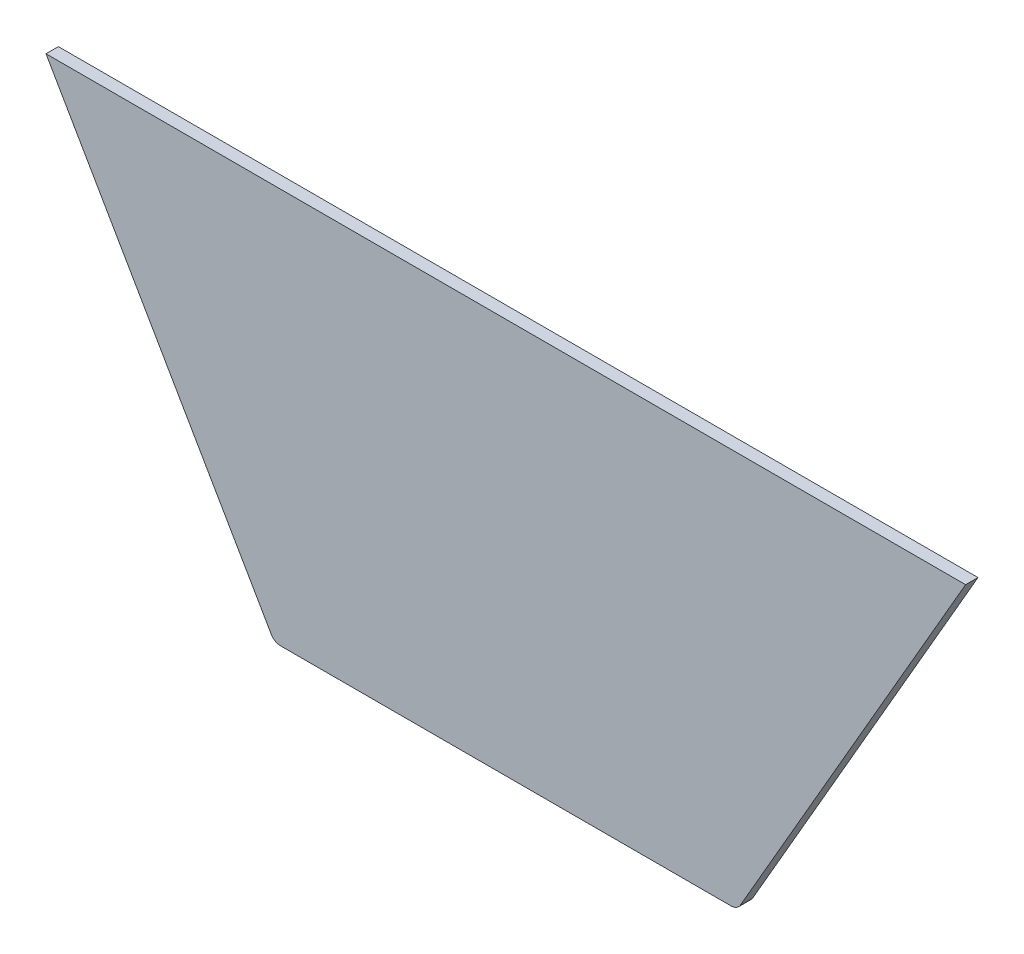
ISO-10303-21;
HEADER;
FILE_DESCRIPTION(('STEP AP214'),'2;1');
FILE_NAME('part.step','',(''),(''),'','','');
FILE_SCHEMA(('AUTOMOTIVE_DESIGN { 1 0 10303 214 1 1 1 1 }'));
ENDSEC;
DATA;
#1=APPLICATION_CONTEXT('core data for automotive mechanical design processes');
#2=APPLICATION_PROTOCOL_DEFINITION('international standard','automotive_design',2000,#1);
#3=PRODUCT_CONTEXT('',#1,'mechanical');
#4=PRODUCT('Part','Part','',(#3));
#5=PRODUCT_RELATED_PRODUCT_CATEGORY('part','',(#4));
#6=PRODUCT_DEFINITION_FORMATION('','',#4);
#7=PRODUCT_DEFINITION_CONTEXT('part definition',#1,'design');
#8=PRODUCT_DEFINITION('design','',#6,#7);
#9=PRODUCT_DEFINITION_SHAPE('','',#8);
#10=(LENGTH_UNIT() NAMED_UNIT(*) SI_UNIT(.MILLI.,.METRE.));
#11=(NAMED_UNIT(*) PLANE_ANGLE_UNIT() SI_UNIT($,.RADIAN.));
#12=(NAMED_UNIT(*) SI_UNIT($,.STERADIAN.) SOLID_ANGLE_UNIT());
#13=UNCERTAINTY_MEASURE_WITH_UNIT(LENGTH_MEASURE(1.E-05),#10,'distance_accuracy_value','');
#14=(GEOMETRIC_REPRESENTATION_CONTEXT(3) GLOBAL_UNCERTAINTY_ASSIGNED_CONTEXT((#13)) GLOBAL_UNIT_ASSIGNED_CONTEXT((#10,
#11,#12)) REPRESENTATION_CONTEXT('',''));
#15=CARTESIAN_POINT('',(0.,0.,0.));
#16=DIRECTION('',(0.,0.,1.));
#17=DIRECTION('',(1.,0.,0.));
#18=AXIS2_PLACEMENT_3D('',#15,#16,#17);
#19=CARTESIAN_POINT('',(-93.0152624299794,-158.439798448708,5.08));
#20=DIRECTION('',(0.,0.,-1.));
#21=DIRECTION('',(-1.,0.,0.));
#22=AXIS2_PLACEMENT_3D('',#19,#20,#21);
#23=CYLINDRICAL_SURFACE('',#22,4.445);
#24=CARTESIAN_POINT('',(-93.0152624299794,-158.439798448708,0.));
#25=DIRECTION('',(0.,0.,1.));
#26=DIRECTION('',(1.,0.,0.));
#27=AXIS2_PLACEMENT_3D('',#24,#25,#26);
#28=CIRCLE('',#27,4.445);
#29=CARTESIAN_POINT('',(-96.8647453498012,-160.662298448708,0.));
#30=VERTEX_POINT('',#29);
#31=CARTESIAN_POINT('',(-93.0152624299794,-162.884798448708,0.));
#32=VERTEX_POINT('',#31);
#33=EDGE_CURVE('E127',#30,#32,#28,.T.);
#34=ORIENTED_EDGE('',*,*,#33,.T.);
#35=DIRECTION('',(0.,0.,-1.));
#36=VECTOR('',#35,1.);
#37=CARTESIAN_POINT('',(-93.0152624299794,-162.884798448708,5.08));
#38=LINE('',#37,#36);
#39=CARTESIAN_POINT('',(-93.0152624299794,-162.884798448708,5.08));
#40=VERTEX_POINT('',#39);
#41=EDGE_CURVE('E11',#40,#32,#38,.T.);
#42=ORIENTED_EDGE('',*,*,#41,.F.);
#43=CARTESIAN_POINT('',(-93.0152624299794,-158.439798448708,5.08));
#44=DIRECTION('',(0.,0.,1.));
#45=DIRECTION('',(1.,0.,0.));
#46=AXIS2_PLACEMENT_3D('',#43,#44,#45);
#47=CIRCLE('',#46,4.445);
#48=CARTESIAN_POINT('',(-96.8647453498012,-160.662298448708,5.08));
#49=VERTEX_POINT('',#48);
#50=EDGE_CURVE('E139',#49,#40,#47,.T.);
#51=ORIENTED_EDGE('',*,*,#50,.F.);
#52=DIRECTION('',(0.,0.,-1.));
#53=VECTOR('',#52,1.);
#54=CARTESIAN_POINT('',(-96.8647453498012,-160.662298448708,5.08));
#55=LINE('',#54,#53);
#56=EDGE_CURVE('E123',#49,#30,#55,.T.);
#57=ORIENTED_EDGE('',*,*,#56,.T.);
#58=EDGE_LOOP('',(#34,#42,#51,#57));
#59=FACE_BOUND('',#58,.T.);
#60=ADVANCED_FACE('F31',(#59),#23,.T.);
#61=CARTESIAN_POINT('',(-93.0152624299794,-162.884798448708,5.08));
#62=DIRECTION('',(0.,1.,0.));
#63=DIRECTION('',(-1.,0.,0.));
#64=AXIS2_PLACEMENT_3D('',#61,#62,#63);
#65=PLANE('',#64);
#66=DIRECTION('',(1.,0.,0.));
#67=VECTOR('',#66,1.);
#68=CARTESIAN_POINT('',(-93.0152624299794,-162.884798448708,0.));
#69=LINE('',#68,#67);
#70=CARTESIAN_POINT('',(91.7599177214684,-162.884798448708,0.));
#71=VERTEX_POINT('',#70);
#72=EDGE_CURVE('E130',#32,#71,#69,.T.);
#73=ORIENTED_EDGE('',*,*,#72,.T.);
#74=DIRECTION('',(0.,0.,-1.));
#75=VECTOR('',#74,1.);
#76=CARTESIAN_POINT('',(91.7599177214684,-162.884798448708,5.08));
#77=LINE('',#76,#75);
#78=CARTESIAN_POINT('',(91.7599177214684,-162.884798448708,5.08));
#79=VERTEX_POINT('',#78);
#80=EDGE_CURVE('E38',#79,#71,#77,.T.);
#81=ORIENTED_EDGE('',*,*,#80,.F.);
#82=DIRECTION('',(1.,0.,0.));
#83=VECTOR('',#82,1.);
#84=CARTESIAN_POINT('',(-93.0152624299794,-162.884798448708,5.08));
#85=LINE('',#84,#83);
#86=EDGE_CURVE('E89',#40,#79,#85,.T.);
#87=ORIENTED_EDGE('',*,*,#86,.F.);
#88=ORIENTED_EDGE('',*,*,#41,.T.);
#89=EDGE_LOOP('',(#73,#81,#87,#88));
#90=FACE_BOUND('',#89,.T.);
#91=ADVANCED_FACE('F252',(#90),#65,.F.);
#92=CARTESIAN_POINT('',(91.7599177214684,-158.439798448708,5.08));
#93=DIRECTION('',(0.,0.,-1.));
#94=DIRECTION('',(-1.,0.,0.));
#95=AXIS2_PLACEMENT_3D('',#92,#93,#94);
#96=CYLINDRICAL_SURFACE('',#95,4.44499999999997);
#97=CARTESIAN_POINT('',(91.7599177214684,-158.439798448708,0.));
#98=DIRECTION('',(0.,0.,1.));
#99=DIRECTION('',(1.,0.,0.));
#100=AXIS2_PLACEMENT_3D('',#97,#98,#99);
#101=CIRCLE('',#100,4.44499999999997);
#102=CARTESIAN_POINT('',(95.6094006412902,-160.662298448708,0.));
#103=VERTEX_POINT('',#102);
#104=EDGE_CURVE('E133',#71,#103,#101,.T.);
#105=ORIENTED_EDGE('',*,*,#104,.T.);
#106=DIRECTION('',(0.,0.,-1.));
#107=VECTOR('',#106,1.);
#108=CARTESIAN_POINT('',(95.6094006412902,-160.662298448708,5.08));
#109=LINE('',#108,#107);
#110=CARTESIAN_POINT('',(95.6094006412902,-160.662298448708,5.08));
#111=VERTEX_POINT('',#110);
#112=EDGE_CURVE('E118',#111,#103,#109,.T.);
#113=ORIENTED_EDGE('',*,*,#112,.F.);
#114=CARTESIAN_POINT('',(91.7599177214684,-158.439798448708,5.08));
#115=DIRECTION('',(0.,0.,1.));
#116=DIRECTION('',(1.,0.,0.));
#117=AXIS2_PLACEMENT_3D('',#114,#115,#116);
#118=CIRCLE('',#117,4.44499999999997);
#119=EDGE_CURVE('E106',#79,#111,#118,.T.);
#120=ORIENTED_EDGE('',*,*,#119,.F.);
#121=ORIENTED_EDGE('',*,*,#80,.T.);
#122=EDGE_LOOP('',(#105,#113,#120,#121));
#123=FACE_BOUND('',#122,.T.);
#124=ADVANCED_FACE('F145',(#123),#96,.T.);
#125=CARTESIAN_POINT('',(95.6094006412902,-160.662298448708,5.08));
#126=DIRECTION('',(-0.866025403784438,0.5,0.));
#127=DIRECTION('',(-0.5,-0.866025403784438,0.));
#128=AXIS2_PLACEMENT_3D('',#125,#126,#127);
#129=PLANE('',#128);
#130=DIRECTION('',(0.5,0.866025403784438,0.));
#131=VECTOR('',#130,1.);
#132=CARTESIAN_POINT('',(95.6094006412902,-160.662298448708,0.));
#133=LINE('',#132,#131);
#134=CARTESIAN_POINT('',(187.996990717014,-0.642298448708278,0.));
#135=VERTEX_POINT('',#134);
#136=EDGE_CURVE('E115',#103,#135,#133,.T.);
#137=ORIENTED_EDGE('',*,*,#136,.T.);
#138=DIRECTION('',(0.,0.,-1.));
#139=VECTOR('',#138,1.);
#140=CARTESIAN_POINT('',(187.996990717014,-0.642298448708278,5.08));
#141=LINE('',#140,#139);
#142=CARTESIAN_POINT('',(187.996990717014,-0.642298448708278,5.08));
#143=VERTEX_POINT('',#142);
#144=EDGE_CURVE('E112',#143,#135,#141,.T.);
#145=ORIENTED_EDGE('',*,*,#144,.F.);
#146=DIRECTION('',(0.5,0.866025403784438,0.));
#147=VECTOR('',#146,1.);
#148=CARTESIAN_POINT('',(95.6094006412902,-160.662298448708,5.08));
#149=LINE('',#148,#147);
#150=EDGE_CURVE('E99',#111,#143,#149,.T.);
#151=ORIENTED_EDGE('',*,*,#150,.F.);
#152=ORIENTED_EDGE('',*,*,#112,.T.);
#153=EDGE_LOOP('',(#137,#145,#151,#152));
#154=FACE_BOUND('',#153,.T.);
#155=ADVANCED_FACE('F113',(#154),#129,.F.);
#156=CARTESIAN_POINT('',(-189.252335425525,-0.64229844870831,5.08));
#157=DIRECTION('',(0.,-1.,0.));
#158=DIRECTION('',(1.,0.,0.));
#159=AXIS2_PLACEMENT_3D('',#156,#157,#158);
#160=PLANE('',#159);
#161=DIRECTION('',(-1.,0.,0.));
#162=VECTOR('',#161,1.);
#163=CARTESIAN_POINT('',(-189.252335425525,-0.64229844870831,0.));
#164=LINE('',#163,#162);
#165=CARTESIAN_POINT('',(-189.252335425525,-0.64229844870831,0.));
#166=VERTEX_POINT('',#165);
#167=EDGE_CURVE('E136',#135,#166,#164,.T.);
#168=ORIENTED_EDGE('',*,*,#167,.T.);
#169=DIRECTION('',(0.,0.,-1.));
#170=VECTOR('',#169,1.);
#171=CARTESIAN_POINT('',(-189.252335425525,-0.64229844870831,5.08));
#172=LINE('',#171,#170);
#173=CARTESIAN_POINT('',(-189.252335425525,-0.64229844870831,5.08));
#174=VERTEX_POINT('',#173);
#175=EDGE_CURVE('E119',#174,#166,#172,.T.);
#176=ORIENTED_EDGE('',*,*,#175,.F.);
#177=DIRECTION('',(-1.,0.,0.));
#178=VECTOR('',#177,1.);
#179=CARTESIAN_POINT('',(-189.252335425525,-0.64229844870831,5.08));
#180=LINE('',#179,#178);
#181=EDGE_CURVE('E103',#143,#174,#180,.T.);
#182=ORIENTED_EDGE('',*,*,#181,.F.);
#183=ORIENTED_EDGE('',*,*,#144,.T.);
#184=EDGE_LOOP('',(#168,#176,#182,#183));
#185=FACE_BOUND('',#184,.T.);
#186=ADVANCED_FACE('F121',(#185),#160,.F.);
#187=CARTESIAN_POINT('',(-189.252335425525,-0.64229844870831,5.08));
#188=DIRECTION('',(0.866025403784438,0.5,0.));
#189=DIRECTION('',(-0.5,0.866025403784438,0.));
#190=AXIS2_PLACEMENT_3D('',#187,#188,#189);
#191=PLANE('',#190);
#192=DIRECTION('',(0.5,-0.866025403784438,0.));
#193=VECTOR('',#192,1.);
#194=CARTESIAN_POINT('',(-189.252335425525,-0.64229844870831,0.));
#195=LINE('',#194,#193);
#196=EDGE_CURVE('E81',#166,#30,#195,.T.);
#197=ORIENTED_EDGE('',*,*,#196,.T.);
#198=ORIENTED_EDGE('',*,*,#56,.F.);
#199=DIRECTION('',(0.5,-0.866025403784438,0.));
#200=VECTOR('',#199,1.);
#201=CARTESIAN_POINT('',(-189.252335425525,-0.64229844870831,5.08));
#202=LINE('',#201,#200);
#203=EDGE_CURVE('E54',#174,#49,#202,.T.);
#204=ORIENTED_EDGE('',*,*,#203,.F.);
#205=ORIENTED_EDGE('',*,*,#175,.T.);
#206=EDGE_LOOP('',(#197,#198,#204,#205));
#207=FACE_BOUND('',#206,.T.);
#208=ADVANCED_FACE('F149',(#207),#191,.F.);
#209=CARTESIAN_POINT('',(-93.0152624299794,-158.439798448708,5.08));
#210=DIRECTION('',(0.,0.,1.));
#211=DIRECTION('',(1.,0.,0.));
#212=AXIS2_PLACEMENT_3D('',#209,#210,#211);
#213=PLANE('',#212);
#214=ORIENTED_EDGE('',*,*,#50,.T.);
#215=ORIENTED_EDGE('',*,*,#86,.T.);
#216=ORIENTED_EDGE('',*,*,#119,.T.);
#217=ORIENTED_EDGE('',*,*,#150,.T.);
#218=ORIENTED_EDGE('',*,*,#181,.T.);
#219=ORIENTED_EDGE('',*,*,#203,.T.);
#220=EDGE_LOOP('',(#214,#215,#216,#217,#218,#219));
#221=FACE_BOUND('',#220,.T.);
#222=ADVANCED_FACE('F101',(#221),#213,.T.);
#223=CARTESIAN_POINT('',(-93.0152624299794,-158.439798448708,0.));
#224=DIRECTION('',(0.,0.,1.));
#225=DIRECTION('',(1.,0.,0.));
#226=AXIS2_PLACEMENT_3D('',#223,#224,#225);
#227=PLANE('',#226);
#228=DIRECTION('',(0.5,-0.866025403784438,0.));
#229=VECTOR('',#228,1.);
#230=CARTESIAN_POINT('',(-187.052630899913,0.627701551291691,0.));
#231=LINE('',#230,#229);
#232=CARTESIAN_POINT('',(-184.8529263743,-3.18229844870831,0.));
#233=VERTEX_POINT('',#232);
#234=CARTESIAN_POINT('',(-94.6650408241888,-159.392298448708,0.));
#235=VERTEX_POINT('',#234);
#236=EDGE_CURVE('E167',#233,#235,#231,.T.);
#237=ORIENTED_EDGE('',*,*,#236,.T.);
#238=CARTESIAN_POINT('',(-93.0152624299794,-158.439798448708,0.));
#239=DIRECTION('',(0.,0.,1.));
#240=DIRECTION('',(1.,0.,0.));
#241=AXIS2_PLACEMENT_3D('',#238,#239,#240);
#242=CIRCLE('',#241,1.905);
#243=CARTESIAN_POINT('',(-93.0152624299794,-160.344798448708,0.));
#244=VERTEX_POINT('',#243);
#245=EDGE_CURVE('E159',#235,#244,#242,.T.);
#246=ORIENTED_EDGE('',*,*,#245,.T.);
#247=DIRECTION('',(1.,0.,0.));
#248=VECTOR('',#247,1.);
#249=CARTESIAN_POINT('',(-93.0152624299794,-160.344798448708,0.));
#250=LINE('',#249,#248);
#251=CARTESIAN_POINT('',(91.7599177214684,-160.344798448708,0.));
#252=VERTEX_POINT('',#251);
#253=EDGE_CURVE('E156',#244,#252,#250,.T.);
#254=ORIENTED_EDGE('',*,*,#253,.T.);
#255=CARTESIAN_POINT('',(91.7599177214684,-158.439798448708,0.));
#256=DIRECTION('',(0.,0.,1.));
#257=DIRECTION('',(1.,0.,0.));
#258=AXIS2_PLACEMENT_3D('',#255,#256,#257);
#259=CIRCLE('',#258,1.90499999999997);
#260=CARTESIAN_POINT('',(93.4096961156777,-159.392298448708,0.));
#261=VERTEX_POINT('',#260);
#262=EDGE_CURVE('E45',#252,#261,#259,.T.);
#263=ORIENTED_EDGE('',*,*,#262,.T.);
#264=DIRECTION('',(0.5,0.866025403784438,0.));
#265=VECTOR('',#264,1.);
#266=CARTESIAN_POINT('',(93.4096961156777,-159.392298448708,0.));
#267=LINE('',#266,#265);
#268=CARTESIAN_POINT('',(183.597581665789,-3.18229844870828,0.));
#269=VERTEX_POINT('',#268);
#270=EDGE_CURVE('E161',#261,#269,#267,.T.);
#271=ORIENTED_EDGE('',*,*,#270,.T.);
#272=DIRECTION('',(-1.,0.,0.));
#273=VECTOR('',#272,1.);
#274=CARTESIAN_POINT('',(-189.252335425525,-3.18229844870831,0.));
#275=LINE('',#274,#273);
#276=EDGE_CURVE('E164',#269,#233,#275,.T.);
#277=ORIENTED_EDGE('',*,*,#276,.T.);
#278=EDGE_LOOP('',(#237,#246,#254,#263,#271,#277));
#279=FACE_BOUND('',#278,.T.);
#280=ORIENTED_EDGE('',*,*,#33,.F.);
#281=ORIENTED_EDGE('',*,*,#196,.F.);
#282=ORIENTED_EDGE('',*,*,#167,.F.);
#283=ORIENTED_EDGE('',*,*,#136,.F.);
#284=ORIENTED_EDGE('',*,*,#104,.F.);
#285=ORIENTED_EDGE('',*,*,#72,.F.);
#286=EDGE_LOOP('',(#280,#281,#282,#283,#284,#285));
#287=FACE_BOUND('',#286,.T.);
#288=ADVANCED_FACE('F148',(#279,#287),#227,.F.);
#289=CARTESIAN_POINT('',(-93.0152624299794,-158.439798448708,5.08));
#290=DIRECTION('',(0.,0.,-1.));
#291=DIRECTION('',(-1.,0.,0.));
#292=AXIS2_PLACEMENT_3D('',#289,#290,#291);
#293=CYLINDRICAL_SURFACE('',#292,1.905);
#294=ORIENTED_EDGE('',*,*,#245,.F.);
#295=DIRECTION('',(0.,0.,-1.));
#296=VECTOR('',#295,1.);
#297=CARTESIAN_POINT('',(-94.6650408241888,-159.392298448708,5.08));
#298=LINE('',#297,#296);
#299=CARTESIAN_POINT('',(-94.6650408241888,-159.392298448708,2.54));
#300=VERTEX_POINT('',#299);
#301=EDGE_CURVE('E176',#300,#235,#298,.T.);
#302=ORIENTED_EDGE('',*,*,#301,.F.);
#303=CARTESIAN_POINT('',(-93.0152624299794,-158.439798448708,2.54));
#304=DIRECTION('',(0.,0.,1.));
#305=DIRECTION('',(1.,0.,0.));
#306=AXIS2_PLACEMENT_3D('',#303,#304,#305);
#307=CIRCLE('',#306,1.905);
#308=CARTESIAN_POINT('',(-93.0152624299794,-160.344798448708,2.54));
#309=VERTEX_POINT('',#308);
#310=EDGE_CURVE('E170',#300,#309,#307,.T.);
#311=ORIENTED_EDGE('',*,*,#310,.T.);
#312=DIRECTION('',(0.,0.,1.));
#313=VECTOR('',#312,1.);
#314=CARTESIAN_POINT('',(-93.0152624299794,-160.344798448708,5.08));
#315=LINE('',#314,#313);
#316=EDGE_CURVE('E131',#309,#244,#315,.F.);
#317=ORIENTED_EDGE('',*,*,#316,.T.);
#318=EDGE_LOOP('',(#294,#302,#311,#317));
#319=FACE_BOUND('',#318,.T.);
#320=ADVANCED_FACE('F207',(#319),#293,.F.);
#321=CARTESIAN_POINT('',(-93.0152624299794,-160.344798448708,5.08));
#322=DIRECTION('',(0.,1.,0.));
#323=DIRECTION('',(-1.,0.,0.));
#324=AXIS2_PLACEMENT_3D('',#321,#322,#323);
#325=PLANE('',#324);
#326=ORIENTED_EDGE('',*,*,#253,.F.);
#327=ORIENTED_EDGE('',*,*,#316,.F.);
#328=DIRECTION('',(1.,0.,0.));
#329=VECTOR('',#328,1.);
#330=CARTESIAN_POINT('',(-93.0152624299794,-160.344798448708,2.54));
#331=LINE('',#330,#329);
#332=CARTESIAN_POINT('',(91.7599177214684,-160.344798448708,2.54));
#333=VERTEX_POINT('',#332);
#334=EDGE_CURVE('E193',#309,#333,#331,.T.);
#335=ORIENTED_EDGE('',*,*,#334,.T.);
#336=DIRECTION('',(0.,0.,-1.));
#337=VECTOR('',#336,1.);
#338=CARTESIAN_POINT('',(91.7599177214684,-160.344798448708,5.08));
#339=LINE('',#338,#337);
#340=EDGE_CURVE('E195',#333,#252,#339,.T.);
#341=ORIENTED_EDGE('',*,*,#340,.T.);
#342=EDGE_LOOP('',(#326,#327,#335,#341));
#343=FACE_BOUND('',#342,.T.);
#344=ADVANCED_FACE('F282',(#343),#325,.T.);
#345=CARTESIAN_POINT('',(91.7599177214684,-158.439798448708,5.08));
#346=DIRECTION('',(0.,0.,-1.));
#347=DIRECTION('',(-1.,0.,0.));
#348=AXIS2_PLACEMENT_3D('',#345,#346,#347);
#349=CYLINDRICAL_SURFACE('',#348,1.90499999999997);
#350=ORIENTED_EDGE('',*,*,#262,.F.);
#351=ORIENTED_EDGE('',*,*,#340,.F.);
#352=CARTESIAN_POINT('',(91.7599177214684,-158.439798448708,2.54));
#353=DIRECTION('',(0.,0.,1.));
#354=DIRECTION('',(1.,0.,0.));
#355=AXIS2_PLACEMENT_3D('',#352,#353,#354);
#356=CIRCLE('',#355,1.90499999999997);
#357=CARTESIAN_POINT('',(93.4096961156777,-159.392298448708,2.54));
#358=VERTEX_POINT('',#357);
#359=EDGE_CURVE('E187',#333,#358,#356,.T.);
#360=ORIENTED_EDGE('',*,*,#359,.T.);
#361=DIRECTION('',(0.,0.,1.));
#362=VECTOR('',#361,1.);
#363=CARTESIAN_POINT('',(93.4096961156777,-159.392298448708,5.08));
#364=LINE('',#363,#362);
#365=EDGE_CURVE('E190',#358,#261,#364,.F.);
#366=ORIENTED_EDGE('',*,*,#365,.T.);
#367=EDGE_LOOP('',(#350,#351,#360,#366));
#368=FACE_BOUND('',#367,.T.);
#369=ADVANCED_FACE('F232',(#368),#349,.F.);
#370=CARTESIAN_POINT('',(93.4096961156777,-159.392298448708,5.08));
#371=DIRECTION('',(-0.866025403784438,0.5,0.));
#372=DIRECTION('',(-0.5,-0.866025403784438,0.));
#373=AXIS2_PLACEMENT_3D('',#370,#371,#372);
#374=PLANE('',#373);
#375=ORIENTED_EDGE('',*,*,#270,.F.);
#376=ORIENTED_EDGE('',*,*,#365,.F.);
#377=DIRECTION('',(0.5,0.866025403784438,0.));
#378=VECTOR('',#377,1.);
#379=CARTESIAN_POINT('',(93.4096961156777,-159.392298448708,2.54));
#380=LINE('',#379,#378);
#381=CARTESIAN_POINT('',(183.597581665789,-3.18229844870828,2.54));
#382=VERTEX_POINT('',#381);
#383=EDGE_CURVE('E180',#358,#382,#380,.T.);
#384=ORIENTED_EDGE('',*,*,#383,.T.);
#385=DIRECTION('',(0.,0.,-1.));
#386=VECTOR('',#385,1.);
#387=CARTESIAN_POINT('',(183.597581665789,-3.18229844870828,5.08));
#388=LINE('',#387,#386);
#389=EDGE_CURVE('E184',#382,#269,#388,.T.);
#390=ORIENTED_EDGE('',*,*,#389,.T.);
#391=EDGE_LOOP('',(#375,#376,#384,#390));
#392=FACE_BOUND('',#391,.T.);
#393=ADVANCED_FACE('F237',(#392),#374,.T.);
#394=CARTESIAN_POINT('',(-189.252335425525,-3.18229844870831,5.08));
#395=DIRECTION('',(0.,-1.,0.));
#396=DIRECTION('',(1.,0.,0.));
#397=AXIS2_PLACEMENT_3D('',#394,#395,#396);
#398=PLANE('',#397);
#399=ORIENTED_EDGE('',*,*,#276,.F.);
#400=ORIENTED_EDGE('',*,*,#389,.F.);
#401=DIRECTION('',(-1.,0.,0.));
#402=VECTOR('',#401,1.);
#403=CARTESIAN_POINT('',(-189.252335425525,-3.18229844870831,2.54));
#404=LINE('',#403,#402);
#405=CARTESIAN_POINT('',(-184.8529263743,-3.18229844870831,2.54));
#406=VERTEX_POINT('',#405);
#407=EDGE_CURVE('E177',#382,#406,#404,.T.);
#408=ORIENTED_EDGE('',*,*,#407,.T.);
#409=DIRECTION('',(0.,0.,-1.));
#410=VECTOR('',#409,1.);
#411=CARTESIAN_POINT('',(-184.8529263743,-3.18229844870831,5.08));
#412=LINE('',#411,#410);
#413=EDGE_CURVE('E181',#406,#233,#412,.T.);
#414=ORIENTED_EDGE('',*,*,#413,.T.);
#415=EDGE_LOOP('',(#399,#400,#408,#414));
#416=FACE_BOUND('',#415,.T.);
#417=ADVANCED_FACE('F241',(#416),#398,.T.);
#418=CARTESIAN_POINT('',(-187.052630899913,0.627701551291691,5.08));
#419=DIRECTION('',(0.866025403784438,0.5,0.));
#420=DIRECTION('',(-0.5,0.866025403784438,0.));
#421=AXIS2_PLACEMENT_3D('',#418,#419,#420);
#422=PLANE('',#421);
#423=ORIENTED_EDGE('',*,*,#236,.F.);
#424=ORIENTED_EDGE('',*,*,#413,.F.);
#425=DIRECTION('',(0.5,-0.866025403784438,0.));
#426=VECTOR('',#425,1.);
#427=CARTESIAN_POINT('',(-187.052630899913,0.627701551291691,2.54));
#428=LINE('',#427,#426);
#429=EDGE_CURVE('E173',#406,#300,#428,.T.);
#430=ORIENTED_EDGE('',*,*,#429,.T.);
#431=ORIENTED_EDGE('',*,*,#301,.T.);
#432=EDGE_LOOP('',(#423,#424,#430,#431));
#433=FACE_BOUND('',#432,.T.);
#434=ADVANCED_FACE('F222',(#433),#422,.T.);
#435=CARTESIAN_POINT('',(-93.0152624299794,-158.439798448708,2.54));
#436=DIRECTION('',(0.,0.,1.));
#437=DIRECTION('',(1.,0.,0.));
#438=AXIS2_PLACEMENT_3D('',#435,#436,#437);
#439=PLANE('',#438);
#440=ORIENTED_EDGE('',*,*,#310,.F.);
#441=ORIENTED_EDGE('',*,*,#429,.F.);
#442=ORIENTED_EDGE('',*,*,#407,.F.);
#443=ORIENTED_EDGE('',*,*,#383,.F.);
#444=ORIENTED_EDGE('',*,*,#359,.F.);
#445=ORIENTED_EDGE('',*,*,#334,.F.);
#446=EDGE_LOOP('',(#440,#441,#442,#443,#444,#445));
#447=FACE_BOUND('',#446,.T.);
#448=ADVANCED_FACE('F248',(#447),#439,.F.);
#449=CLOSED_SHELL('',(#60,#91,#124,#155,#186,#208,#222,#288,#320,#344,#369,#393,#417,#434,#448));
#450=MANIFOLD_SOLID_BREP('B2',#449);
#451=ADVANCED_BREP_SHAPE_REPRESENTATION('',(#18,#450),#14);
#452=SHAPE_DEFINITION_REPRESENTATION(#9,#451);
ENDSEC;
END-ISO-10303-21;
